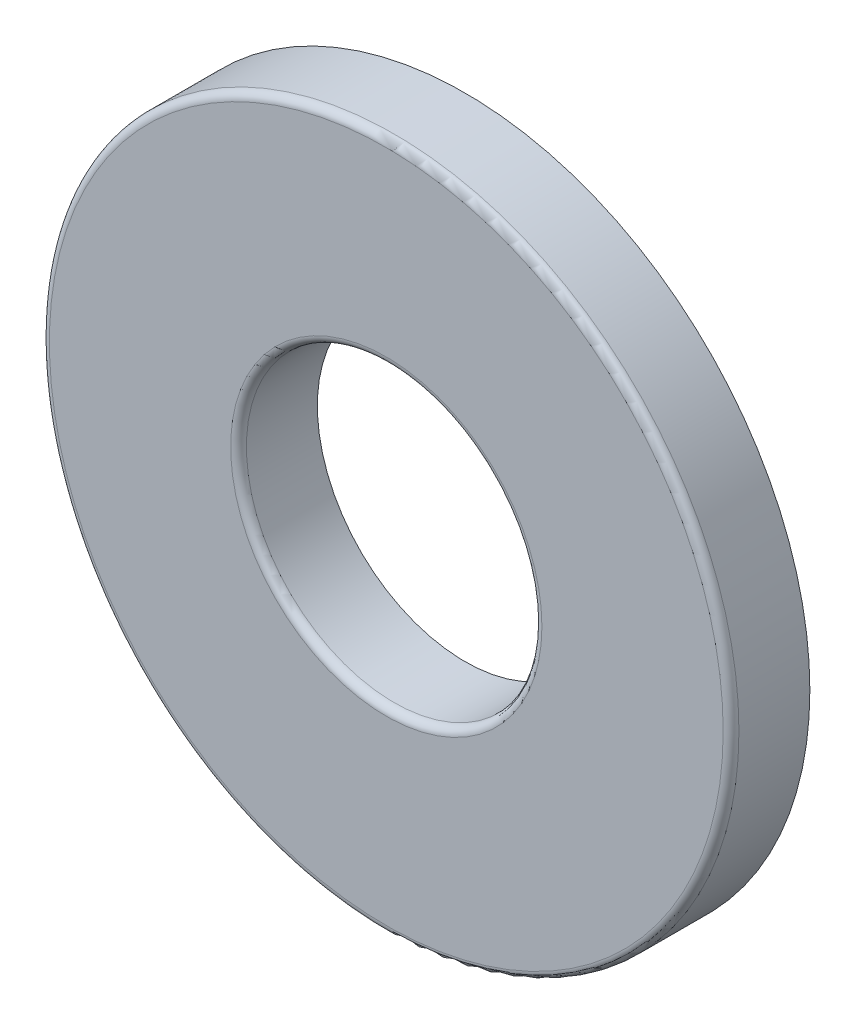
from build123d import *

# Parameters (mm, degrees)
BOSS_EXTRUDE1_START = 1.27
SKETCH3_R           = 11.1125
SKETCH3_R_2         = 4.7625
BOSS_EXTRUDE1_DEPTH = 2.54
FILLET1_R           = 0.254


with BuildPart() as part:
    # Sketch3 → Boss-Extrude1 (new body)
    with BuildSketch(Plane.XY.offset(BOSS_EXTRUDE1_START)):
        Circle(SKETCH3_R)
        Circle(SKETCH3_R_2, mode=Mode.SUBTRACT)
    extrude(amount=-BOSS_EXTRUDE1_DEPTH)

    # Fillet1
    fillet1_edges = [part.edges().sort_by_distance(p)[0] for p in [
        (-11.1125, 0, 1.27),
        (-4.7625, 0, 1.27),
    ]]
    fillet(fillet1_edges, radius=FILLET1_R)


solid = part.part
